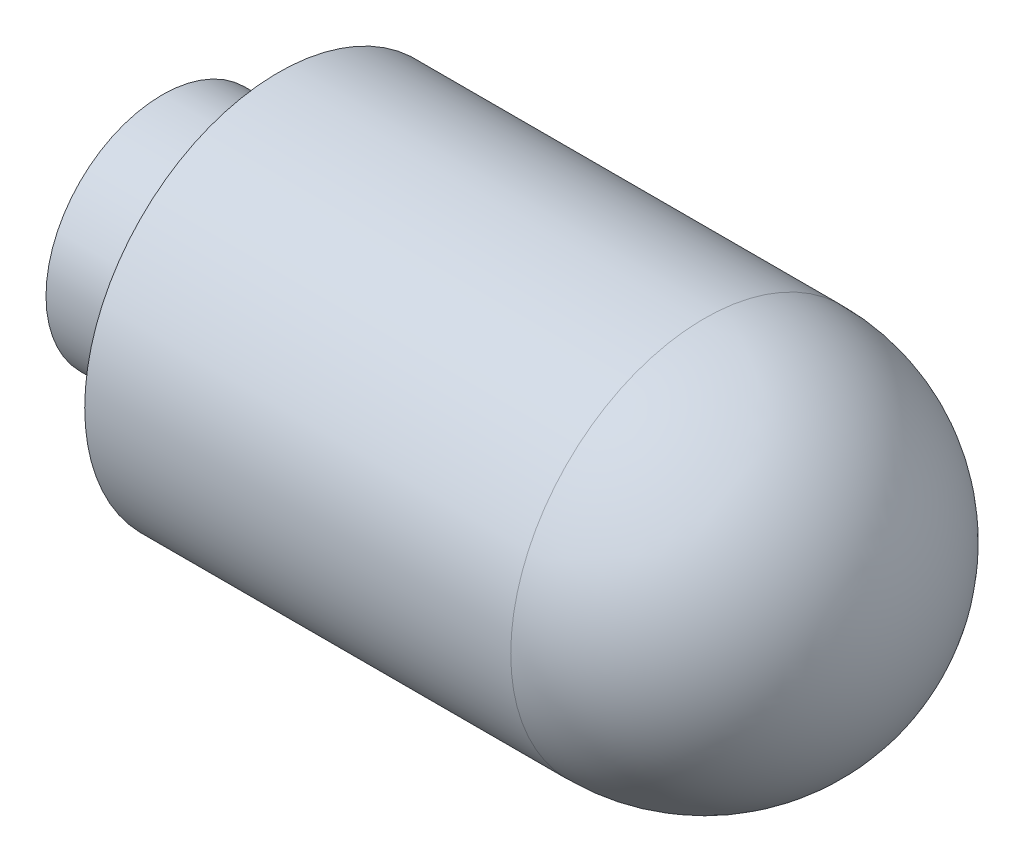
from build123d import *

# Parameters (mm, degrees)
CONG_1_R = 2.5


with BuildPart() as part:
    # Esquisse1 → R_volution1 (revolve)
    with BuildSketch(Plane.XY, mode=Mode.PRIVATE) as r_volution1_sk:
        Polygon((0, 0), (0, 1.5), (1.5, 1.5), (1.5, 2.5), (9.5, 2.5), (9.5, 0), align=None)
    revolve(r_volution1_sk.sketch.rotate(Axis((-4.214245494, 0, 0), (1, 0, 0)), 90), axis=Axis((-4.214245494, 0, 0), (1, 0, 0)))

    # Cong_1
    cong_1_edges = [part.edges().sort_by_distance(p)[0] for p in [
        (9.5, 0, -2.5),
    ]]
    fillet(cong_1_edges, radius=CONG_1_R)


solid = part.part
